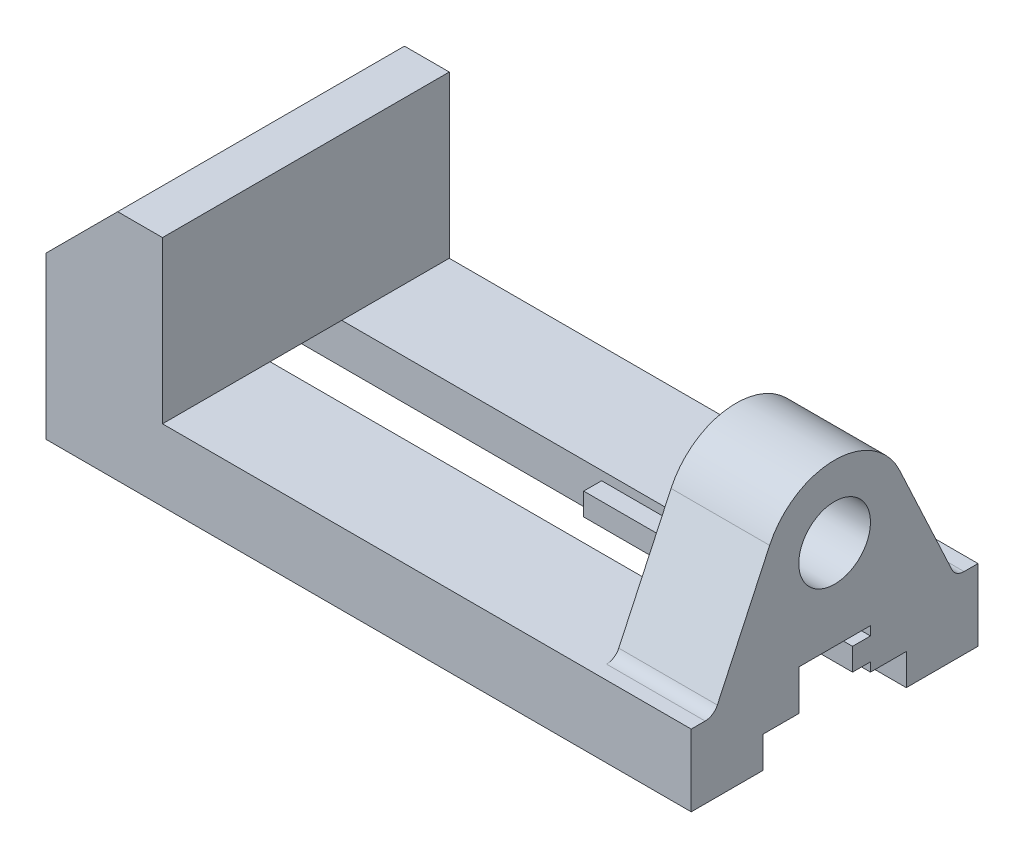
ISO-10303-21;
HEADER;
FILE_DESCRIPTION(('STEP AP214'),'2;1');
FILE_NAME('part.step','',(''),(''),'','','');
FILE_SCHEMA(('AUTOMOTIVE_DESIGN { 1 0 10303 214 1 1 1 1 }'));
ENDSEC;
DATA;
#1=APPLICATION_CONTEXT('core data for automotive mechanical design processes');
#2=APPLICATION_PROTOCOL_DEFINITION('international standard','automotive_design',2000,#1);
#3=PRODUCT_CONTEXT('',#1,'mechanical');
#4=PRODUCT('Part','Part','',(#3));
#5=PRODUCT_RELATED_PRODUCT_CATEGORY('part','',(#4));
#6=PRODUCT_DEFINITION_FORMATION('','',#4);
#7=PRODUCT_DEFINITION_CONTEXT('part definition',#1,'design');
#8=PRODUCT_DEFINITION('design','',#6,#7);
#9=PRODUCT_DEFINITION_SHAPE('','',#8);
#10=(LENGTH_UNIT() NAMED_UNIT(*) SI_UNIT(.MILLI.,.METRE.));
#11=(NAMED_UNIT(*) PLANE_ANGLE_UNIT() SI_UNIT($,.RADIAN.));
#12=(NAMED_UNIT(*) SI_UNIT($,.STERADIAN.) SOLID_ANGLE_UNIT());
#13=UNCERTAINTY_MEASURE_WITH_UNIT(LENGTH_MEASURE(1.E-05),#10,'distance_accuracy_value','');
#14=(GEOMETRIC_REPRESENTATION_CONTEXT(3) GLOBAL_UNCERTAINTY_ASSIGNED_CONTEXT((#13)) GLOBAL_UNIT_ASSIGNED_CONTEXT((#10,
#11,#12)) REPRESENTATION_CONTEXT('',''));
#15=CARTESIAN_POINT('',(0.,0.,0.));
#16=DIRECTION('',(0.,0.,1.));
#17=DIRECTION('',(1.,0.,0.));
#18=AXIS2_PLACEMENT_3D('',#15,#16,#17);
#19=CARTESIAN_POINT('',(0.,0.,32.));
#20=DIRECTION('',(0.,1.,0.));
#21=DIRECTION('',(0.,0.,1.));
#22=AXIS2_PLACEMENT_3D('',#19,#20,#21);
#23=PLANE('',#22);
#24=CARTESIAN_POINT('',(36.,0.,22.));
#25=DIRECTION('',(0.,-1.,0.));
#26=DIRECTION('',(0.,0.,-1.));
#27=AXIS2_PLACEMENT_3D('',#24,#25,#26);
#28=CIRCLE('',#27,3.);
#29=CARTESIAN_POINT('',(36.,0.,19.));
#30=VERTEX_POINT('',#29);
#31=EDGE_CURVE('E270',#30,#30,#28,.T.);
#32=ORIENTED_EDGE('',*,*,#31,.F.);
#33=EDGE_LOOP('',(#32));
#34=FACE_BOUND('',#33,.T.);
#35=CARTESIAN_POINT('',(106.,0.,22.));
#36=DIRECTION('',(0.,-1.,0.));
#37=DIRECTION('',(0.,0.,-1.));
#38=AXIS2_PLACEMENT_3D('',#35,#36,#37);
#39=CIRCLE('',#38,3.);
#40=CARTESIAN_POINT('',(106.,0.,19.));
#41=VERTEX_POINT('',#40);
#42=EDGE_CURVE('E276',#41,#41,#39,.T.);
#43=ORIENTED_EDGE('',*,*,#42,.F.);
#44=EDGE_LOOP('',(#43));
#45=FACE_BOUND('',#44,.T.);
#46=DIRECTION('',(0.,0.,-1.));
#47=VECTOR('',#46,1.);
#48=CARTESIAN_POINT('',(0.,0.,32.));
#49=LINE('',#48,#47);
#50=CARTESIAN_POINT('',(0.,0.,32.));
#51=VERTEX_POINT('',#50);
#52=CARTESIAN_POINT('',(0.,0.,16.));
#53=VERTEX_POINT('',#52);
#54=EDGE_CURVE('E434',#51,#53,#49,.T.);
#55=ORIENTED_EDGE('',*,*,#54,.T.);
#56=DIRECTION('',(1.,0.,0.));
#57=VECTOR('',#56,1.);
#58=CARTESIAN_POINT('',(0.,0.,16.));
#59=LINE('',#58,#57);
#60=CARTESIAN_POINT('',(144.,0.,16.));
#61=VERTEX_POINT('',#60);
#62=EDGE_CURVE('E324',#53,#61,#59,.T.);
#63=ORIENTED_EDGE('',*,*,#62,.T.);
#64=DIRECTION('',(0.,0.,-1.));
#65=VECTOR('',#64,1.);
#66=CARTESIAN_POINT('',(144.,0.,32.));
#67=LINE('',#66,#65);
#68=CARTESIAN_POINT('',(144.,0.,32.));
#69=VERTEX_POINT('',#68);
#70=EDGE_CURVE('E430',#69,#61,#67,.T.);
#71=ORIENTED_EDGE('',*,*,#70,.F.);
#72=DIRECTION('',(1.,0.,0.));
#73=VECTOR('',#72,1.);
#74=CARTESIAN_POINT('',(0.,0.,32.));
#75=LINE('',#74,#73);
#76=EDGE_CURVE('E388',#51,#69,#75,.T.);
#77=ORIENTED_EDGE('',*,*,#76,.F.);
#78=EDGE_LOOP('',(#55,#63,#71,#77));
#79=FACE_BOUND('',#78,.T.);
#80=ADVANCED_FACE('F34',(#34,#45,#79),#23,.F.);
#81=CARTESIAN_POINT('',(144.,16.,32.));
#82=DIRECTION('',(0.,-1.,0.));
#83=DIRECTION('',(1.,0.,0.));
#84=AXIS2_PLACEMENT_3D('',#81,#82,#83);
#85=PLANE('',#84);
#86=DIRECTION('',(0.,0.,-1.));
#87=VECTOR('',#86,1.);
#88=CARTESIAN_POINT('',(122.,16.,26.9801998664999));
#89=LINE('',#88,#87);
#90=CARTESIAN_POINT('',(122.,16.,28.8914106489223));
#91=VERTEX_POINT('',#90);
#92=CARTESIAN_POINT('',(122.,16.,7.99999999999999));
#93=VERTEX_POINT('',#92);
#94=EDGE_CURVE('E356',#91,#93,#89,.T.);
#95=ORIENTED_EDGE('',*,*,#94,.T.);
#96=DIRECTION('',(1.,0.,0.));
#97=VECTOR('',#96,1.);
#98=CARTESIAN_POINT('',(0.,16.,7.99999999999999));
#99=LINE('',#98,#97);
#100=CARTESIAN_POINT('',(26.,16.,7.99999999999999));
#101=VERTEX_POINT('',#100);
#102=EDGE_CURVE('E335',#101,#93,#99,.T.);
#103=ORIENTED_EDGE('',*,*,#102,.F.);
#104=DIRECTION('',(0.,0.,-1.));
#105=VECTOR('',#104,1.);
#106=CARTESIAN_POINT('',(26.,16.,32.));
#107=LINE('',#106,#105);
#108=CARTESIAN_POINT('',(26.,16.,32.));
#109=VERTEX_POINT('',#108);
#110=EDGE_CURVE('E422',#109,#101,#107,.T.);
#111=ORIENTED_EDGE('',*,*,#110,.F.);
#112=DIRECTION('',(-1.,0.,0.));
#113=VECTOR('',#112,1.);
#114=CARTESIAN_POINT('',(144.,16.,32.));
#115=LINE('',#114,#113);
#116=CARTESIAN_POINT('',(144.,16.,32.));
#117=VERTEX_POINT('',#116);
#118=EDGE_CURVE('E392',#117,#109,#115,.T.);
#119=ORIENTED_EDGE('',*,*,#118,.F.);
#120=DIRECTION('',(0.,0.,-1.));
#121=VECTOR('',#120,1.);
#122=CARTESIAN_POINT('',(144.,16.,32.));
#123=LINE('',#122,#121);
#124=CARTESIAN_POINT('',(144.,16.,28.8914106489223));
#125=VERTEX_POINT('',#124);
#126=EDGE_CURVE('E426',#117,#125,#123,.T.);
#127=ORIENTED_EDGE('',*,*,#126,.T.);
#128=DIRECTION('',(1.,0.,0.));
#129=VECTOR('',#128,1.);
#130=CARTESIAN_POINT('',(144.,16.,28.8914106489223));
#131=LINE('',#130,#129);
#132=EDGE_CURVE('E440',#125,#91,#131,.F.);
#133=ORIENTED_EDGE('',*,*,#132,.T.);
#134=EDGE_LOOP('',(#95,#103,#111,#119,#127,#133));
#135=FACE_BOUND('',#134,.T.);
#136=ADVANCED_FACE('F466',(#135),#85,.F.);
#137=CARTESIAN_POINT('',(16.,52.,32.));
#138=DIRECTION('',(0.707106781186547,-0.707106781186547,0.));
#139=DIRECTION('',(0.707106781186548,0.707106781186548,0.));
#140=AXIS2_PLACEMENT_3D('',#137,#138,#139);
#141=PLANE('',#140);
#142=DIRECTION('',(-0.707106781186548,-0.707106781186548,0.));
#143=VECTOR('',#142,1.);
#144=CARTESIAN_POINT('',(16.,52.,-32.));
#145=LINE('',#144,#143);
#146=CARTESIAN_POINT('',(16.,52.,-32.));
#147=VERTEX_POINT('',#146);
#148=CARTESIAN_POINT('',(0.,36.,-32.));
#149=VERTEX_POINT('',#148);
#150=EDGE_CURVE('E379',#147,#149,#145,.T.);
#151=ORIENTED_EDGE('',*,*,#150,.T.);
#152=DIRECTION('',(0.,0.,-1.));
#153=VECTOR('',#152,1.);
#154=CARTESIAN_POINT('',(0.,36.,32.));
#155=LINE('',#154,#153);
#156=CARTESIAN_POINT('',(0.,36.,32.));
#157=VERTEX_POINT('',#156);
#158=EDGE_CURVE('E437',#157,#149,#155,.T.);
#159=ORIENTED_EDGE('',*,*,#158,.F.);
#160=DIRECTION('',(-0.707106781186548,-0.707106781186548,0.));
#161=VECTOR('',#160,1.);
#162=CARTESIAN_POINT('',(16.,52.,32.));
#163=LINE('',#162,#161);
#164=CARTESIAN_POINT('',(16.,52.,32.));
#165=VERTEX_POINT('',#164);
#166=EDGE_CURVE('E382',#165,#157,#163,.T.);
#167=ORIENTED_EDGE('',*,*,#166,.F.);
#168=DIRECTION('',(0.,0.,-1.));
#169=VECTOR('',#168,1.);
#170=CARTESIAN_POINT('',(16.,52.,32.));
#171=LINE('',#170,#169);
#172=EDGE_CURVE('E398',#165,#147,#171,.T.);
#173=ORIENTED_EDGE('',*,*,#172,.T.);
#174=EDGE_LOOP('',(#151,#159,#167,#173));
#175=FACE_BOUND('',#174,.T.);
#176=ADVANCED_FACE('F555',(#175),#141,.F.);
#177=CARTESIAN_POINT('',(0.,36.,32.));
#178=DIRECTION('',(1.,0.,0.));
#179=DIRECTION('',(0.,1.,0.));
#180=AXIS2_PLACEMENT_3D('',#177,#178,#179);
#181=PLANE('',#180);
#182=DIRECTION('',(0.,0.,1.));
#183=VECTOR('',#182,1.);
#184=CARTESIAN_POINT('',(0.,7.,16.));
#185=LINE('',#184,#183);
#186=CARTESIAN_POINT('',(0.,7.,8.00000000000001));
#187=VERTEX_POINT('',#186);
#188=CARTESIAN_POINT('',(0.,7.,16.));
#189=VERTEX_POINT('',#188);
#190=EDGE_CURVE('E299',#187,#189,#185,.T.);
#191=ORIENTED_EDGE('',*,*,#190,.T.);
#192=DIRECTION('',(0.,-1.,0.));
#193=VECTOR('',#192,1.);
#194=CARTESIAN_POINT('',(0.,0.,16.));
#195=LINE('',#194,#193);
#196=EDGE_CURVE('E302',#189,#53,#195,.T.);
#197=ORIENTED_EDGE('',*,*,#196,.T.);
#198=ORIENTED_EDGE('',*,*,#54,.F.);
#199=DIRECTION('',(0.,-1.,0.));
#200=VECTOR('',#199,1.);
#201=CARTESIAN_POINT('',(0.,36.,32.));
#202=LINE('',#201,#200);
#203=EDGE_CURVE('E385',#157,#51,#202,.T.);
#204=ORIENTED_EDGE('',*,*,#203,.F.);
#205=ORIENTED_EDGE('',*,*,#158,.T.);
#206=DIRECTION('',(0.,-1.,0.));
#207=VECTOR('',#206,1.);
#208=CARTESIAN_POINT('',(0.,36.,-32.));
#209=LINE('',#208,#207);
#210=CARTESIAN_POINT('',(0.,0.,-32.));
#211=VERTEX_POINT('',#210);
#212=EDGE_CURVE('E401',#149,#211,#209,.T.);
#213=ORIENTED_EDGE('',*,*,#212,.T.);
#214=CARTESIAN_POINT('',(0.,0.,-16.));
#215=VERTEX_POINT('',#214);
#216=EDGE_CURVE('E433',#215,#211,#49,.T.);
#217=ORIENTED_EDGE('',*,*,#216,.F.);
#218=DIRECTION('',(0.,1.,0.));
#219=VECTOR('',#218,1.);
#220=CARTESIAN_POINT('',(0.,7.,-16.));
#221=LINE('',#220,#219);
#222=CARTESIAN_POINT('',(0.,7.,-16.));
#223=VERTEX_POINT('',#222);
#224=EDGE_CURVE('E283',#215,#223,#221,.T.);
#225=ORIENTED_EDGE('',*,*,#224,.T.);
#226=DIRECTION('',(0.,0.,1.));
#227=VECTOR('',#226,1.);
#228=CARTESIAN_POINT('',(0.,7.,-8.));
#229=LINE('',#228,#227);
#230=CARTESIAN_POINT('',(0.,7.,-8.));
#231=VERTEX_POINT('',#230);
#232=EDGE_CURVE('E286',#223,#231,#229,.T.);
#233=ORIENTED_EDGE('',*,*,#232,.T.);
#234=DIRECTION('',(0.,1.,0.));
#235=VECTOR('',#234,1.);
#236=CARTESIAN_POINT('',(0.,16.,-8.));
#237=LINE('',#236,#235);
#238=CARTESIAN_POINT('',(0.,16.,-8.));
#239=VERTEX_POINT('',#238);
#240=EDGE_CURVE('E290',#231,#239,#237,.T.);
#241=ORIENTED_EDGE('',*,*,#240,.T.);
#242=DIRECTION('',(0.,0.,1.));
#243=VECTOR('',#242,1.);
#244=CARTESIAN_POINT('',(0.,16.,7.99999999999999));
#245=LINE('',#244,#243);
#246=CARTESIAN_POINT('',(0.,16.,7.99999999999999));
#247=VERTEX_POINT('',#246);
#248=EDGE_CURVE('E293',#239,#247,#245,.T.);
#249=ORIENTED_EDGE('',*,*,#248,.T.);
#250=DIRECTION('',(0.,-1.,0.));
#251=VECTOR('',#250,1.);
#252=CARTESIAN_POINT('',(0.,7.,8.00000000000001));
#253=LINE('',#252,#251);
#254=EDGE_CURVE('E296',#247,#187,#253,.T.);
#255=ORIENTED_EDGE('',*,*,#254,.T.);
#256=EDGE_LOOP('',(#191,#197,#198,#204,#205,#213,#217,#225,#233,#241,#249,#255));
#257=FACE_BOUND('',#256,.T.);
#258=ADVANCED_FACE('F528',(#257),#181,.F.);
#259=CARTESIAN_POINT('',(106.,0.,-22.));
#260=DIRECTION('',(0.,-1.,0.));
#261=DIRECTION('',(0.,0.,-1.));
#262=AXIS2_PLACEMENT_3D('',#259,#260,#261);
#263=CIRCLE('',#262,3.);
#264=CARTESIAN_POINT('',(106.,0.,-25.));
#265=VERTEX_POINT('',#264);
#266=EDGE_CURVE('E256',#265,#265,#263,.T.);
#267=ORIENTED_EDGE('',*,*,#266,.F.);
#268=EDGE_LOOP('',(#267));
#269=FACE_BOUND('',#268,.T.);
#270=CARTESIAN_POINT('',(36.,0.,-22.));
#271=DIRECTION('',(0.,-1.,0.));
#272=DIRECTION('',(0.,0.,-1.));
#273=AXIS2_PLACEMENT_3D('',#270,#271,#272);
#274=CIRCLE('',#273,3.);
#275=CARTESIAN_POINT('',(36.,0.,-25.));
#276=VERTEX_POINT('',#275);
#277=EDGE_CURVE('E264',#276,#276,#274,.T.);
#278=ORIENTED_EDGE('',*,*,#277,.F.);
#279=EDGE_LOOP('',(#278));
#280=FACE_BOUND('',#279,.T.);
#281=CARTESIAN_POINT('',(144.,0.,-16.));
#282=VERTEX_POINT('',#281);
#283=CARTESIAN_POINT('',(144.,0.,-32.));
#284=VERTEX_POINT('',#283);
#285=EDGE_CURVE('E429',#282,#284,#67,.T.);
#286=ORIENTED_EDGE('',*,*,#285,.F.);
#287=DIRECTION('',(1.,0.,0.));
#288=VECTOR('',#287,1.);
#289=CARTESIAN_POINT('',(0.,0.,-16.));
#290=LINE('',#289,#288);
#291=EDGE_CURVE('E305',#215,#282,#290,.T.);
#292=ORIENTED_EDGE('',*,*,#291,.F.);
#293=ORIENTED_EDGE('',*,*,#216,.T.);
#294=DIRECTION('',(1.,0.,0.));
#295=VECTOR('',#294,1.);
#296=CARTESIAN_POINT('',(0.,0.,-32.));
#297=LINE('',#296,#295);
#298=EDGE_CURVE('E404',#211,#284,#297,.T.);
#299=ORIENTED_EDGE('',*,*,#298,.T.);
#300=EDGE_LOOP('',(#286,#292,#293,#299));
#301=FACE_BOUND('',#300,.T.);
#302=ADVANCED_FACE('F551',(#269,#280,#301),#23,.F.);
#303=CARTESIAN_POINT('',(144.,0.,32.));
#304=DIRECTION('',(-1.,0.,0.));
#305=DIRECTION('',(0.,0.,1.));
#306=AXIS2_PLACEMENT_3D('',#303,#304,#305);
#307=PLANE('',#306);
#308=ORIENTED_EDGE('',*,*,#70,.T.);
#309=DIRECTION('',(0.,-1.,0.));
#310=VECTOR('',#309,1.);
#311=CARTESIAN_POINT('',(144.,0.,16.));
#312=LINE('',#311,#310);
#313=CARTESIAN_POINT('',(144.,7.,16.));
#314=VERTEX_POINT('',#313);
#315=EDGE_CURVE('E287',#314,#61,#312,.T.);
#316=ORIENTED_EDGE('',*,*,#315,.F.);
#317=DIRECTION('',(0.,0.,1.));
#318=VECTOR('',#317,1.);
#319=CARTESIAN_POINT('',(144.,7.,16.));
#320=LINE('',#319,#318);
#321=CARTESIAN_POINT('',(144.,7.,8.00000000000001));
#322=VERTEX_POINT('',#321);
#323=EDGE_CURVE('E320',#322,#314,#320,.T.);
#324=ORIENTED_EDGE('',*,*,#323,.F.);
#325=DIRECTION('',(0.,-1.,0.));
#326=VECTOR('',#325,1.);
#327=CARTESIAN_POINT('',(144.,7.,8.00000000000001));
#328=LINE('',#327,#326);
#329=CARTESIAN_POINT('',(144.,16.,7.99999999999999));
#330=VERTEX_POINT('',#329);
#331=EDGE_CURVE('E317',#330,#322,#328,.T.);
#332=ORIENTED_EDGE('',*,*,#331,.F.);
#333=DIRECTION('',(0.,0.,1.));
#334=VECTOR('',#333,1.);
#335=CARTESIAN_POINT('',(144.,16.,7.99999999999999));
#336=LINE('',#335,#334);
#337=CARTESIAN_POINT('',(144.,16.,-8.));
#338=VERTEX_POINT('',#337);
#339=EDGE_CURVE('E314',#338,#330,#336,.T.);
#340=ORIENTED_EDGE('',*,*,#339,.F.);
#341=DIRECTION('',(0.,1.,0.));
#342=VECTOR('',#341,1.);
#343=CARTESIAN_POINT('',(144.,16.,-8.));
#344=LINE('',#343,#342);
#345=CARTESIAN_POINT('',(144.,13.9999999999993,-8.));
#346=VERTEX_POINT('',#345);
#347=EDGE_CURVE('E311',#346,#338,#344,.T.);
#348=ORIENTED_EDGE('',*,*,#347,.F.);
#349=DIRECTION('',(0.,0.,1.));
#350=VECTOR('',#349,1.);
#351=CARTESIAN_POINT('',(144.,13.9999999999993,-8.));
#352=LINE('',#351,#350);
#353=CARTESIAN_POINT('',(144.,13.9999999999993,-4.));
#354=VERTEX_POINT('',#353);
#355=EDGE_CURVE('E250',#346,#354,#352,.T.);
#356=ORIENTED_EDGE('',*,*,#355,.T.);
#357=DIRECTION('',(0.,-1.,0.));
#358=VECTOR('',#357,1.);
#359=CARTESIAN_POINT('',(144.,13.9999999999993,-4.));
#360=LINE('',#359,#358);
#361=CARTESIAN_POINT('',(144.,8.99999999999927,-4.));
#362=VERTEX_POINT('',#361);
#363=EDGE_CURVE('E229',#354,#362,#360,.T.);
#364=ORIENTED_EDGE('',*,*,#363,.T.);
#365=DIRECTION('',(0.,0.,-1.));
#366=VECTOR('',#365,1.);
#367=CARTESIAN_POINT('',(144.,8.99999999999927,-8.));
#368=LINE('',#367,#366);
#369=CARTESIAN_POINT('',(144.,8.99999999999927,-8.));
#370=VERTEX_POINT('',#369);
#371=EDGE_CURVE('E246',#362,#370,#368,.T.);
#372=ORIENTED_EDGE('',*,*,#371,.T.);
#373=CARTESIAN_POINT('',(144.,7.,-8.));
#374=VERTEX_POINT('',#373);
#375=EDGE_CURVE('E312',#374,#370,#344,.T.);
#376=ORIENTED_EDGE('',*,*,#375,.F.);
#377=DIRECTION('',(0.,0.,1.));
#378=VECTOR('',#377,1.);
#379=CARTESIAN_POINT('',(144.,7.,-8.));
#380=LINE('',#379,#378);
#381=CARTESIAN_POINT('',(144.,7.,-16.));
#382=VERTEX_POINT('',#381);
#383=EDGE_CURVE('E308',#382,#374,#380,.T.);
#384=ORIENTED_EDGE('',*,*,#383,.F.);
#385=DIRECTION('',(0.,1.,0.));
#386=VECTOR('',#385,1.);
#387=CARTESIAN_POINT('',(144.,7.,-16.));
#388=LINE('',#387,#386);
#389=EDGE_CURVE('E282',#282,#382,#388,.T.);
#390=ORIENTED_EDGE('',*,*,#389,.F.);
#391=ORIENTED_EDGE('',*,*,#285,.T.);
#392=DIRECTION('',(0.,1.,0.));
#393=VECTOR('',#392,1.);
#394=CARTESIAN_POINT('',(144.,0.,-32.));
#395=LINE('',#394,#393);
#396=CARTESIAN_POINT('',(144.,16.,-32.));
#397=VERTEX_POINT('',#396);
#398=EDGE_CURVE('E407',#284,#397,#395,.T.);
#399=ORIENTED_EDGE('',*,*,#398,.T.);
#400=CARTESIAN_POINT('',(144.,16.,-28.8914106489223));
#401=VERTEX_POINT('',#400);
#402=EDGE_CURVE('E425',#401,#397,#123,.T.);
#403=ORIENTED_EDGE('',*,*,#402,.F.);
#404=CARTESIAN_POINT('',(144.,19.,-28.8914106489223));
#405=DIRECTION('',(-1.,0.,0.));
#406=DIRECTION('',(0.,0.,1.));
#407=AXIS2_PLACEMENT_3D('',#404,#405,#406);
#408=CIRCLE('',#407,3.);
#409=CARTESIAN_POINT('',(144.,17.7321452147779,-26.1724872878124));
#410=VERTEX_POINT('',#409);
#411=EDGE_CURVE('E451',#401,#410,#408,.T.);
#412=ORIENTED_EDGE('',*,*,#411,.T.);
#413=DIRECTION('',(0.,0.906307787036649,0.4226182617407));
#414=VECTOR('',#413,1.);
#415=CARTESIAN_POINT('',(144.,16.,-26.9801998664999));
#416=LINE('',#415,#414);
#417=CARTESIAN_POINT('',(144.,42.7618921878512,-14.5009245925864));
#418=VERTEX_POINT('',#417);
#419=EDGE_CURVE('E353',#410,#418,#416,.T.);
#420=ORIENTED_EDGE('',*,*,#419,.T.);
#421=CARTESIAN_POINT('',(144.,36.,0.));
#422=DIRECTION('',(1.,0.,0.));
#423=DIRECTION('',(0.,0.,-1.));
#424=AXIS2_PLACEMENT_3D('',#421,#422,#423);
#425=CIRCLE('',#424,16.);
#426=CARTESIAN_POINT('',(144.,42.7618921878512,14.5009245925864));
#427=VERTEX_POINT('',#426);
#428=EDGE_CURVE('E371',#418,#427,#425,.T.);
#429=ORIENTED_EDGE('',*,*,#428,.T.);
#430=DIRECTION('',(0.,-0.906307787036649,0.4226182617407));
#431=VECTOR('',#430,1.);
#432=CARTESIAN_POINT('',(144.,16.,26.9801998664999));
#433=LINE('',#432,#431);
#434=CARTESIAN_POINT('',(144.,17.7321452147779,26.1724872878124));
#435=VERTEX_POINT('',#434);
#436=EDGE_CURVE('E374',#427,#435,#433,.T.);
#437=ORIENTED_EDGE('',*,*,#436,.T.);
#438=CARTESIAN_POINT('',(144.,19.,28.8914106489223));
#439=DIRECTION('',(-1.,0.,0.));
#440=DIRECTION('',(0.,0.,1.));
#441=AXIS2_PLACEMENT_3D('',#438,#439,#440);
#442=CIRCLE('',#441,3.);
#443=EDGE_CURVE('E42',#435,#125,#442,.T.);
#444=ORIENTED_EDGE('',*,*,#443,.T.);
#445=ORIENTED_EDGE('',*,*,#126,.F.);
#446=DIRECTION('',(0.,1.,0.));
#447=VECTOR('',#446,1.);
#448=CARTESIAN_POINT('',(144.,0.,32.));
#449=LINE('',#448,#447);
#450=EDGE_CURVE('E390',#69,#117,#449,.T.);
#451=ORIENTED_EDGE('',*,*,#450,.F.);
#452=EDGE_LOOP('',(#308,#316,#324,#332,#340,#348,#356,#364,#372,#376,#384,#390,#391,#399,#403,
#412,#420,#429,#437,#444,#445,#451));
#453=FACE_BOUND('',#452,.T.);
#454=CARTESIAN_POINT('',(144.,36.,0.));
#455=DIRECTION('',(1.,0.,0.));
#456=DIRECTION('',(0.,0.,-1.));
#457=AXIS2_PLACEMENT_3D('',#454,#455,#456);
#458=CIRCLE('',#457,8.);
#459=CARTESIAN_POINT('',(144.,36.,-8.));
#460=VERTEX_POINT('',#459);
#461=EDGE_CURVE('E349',#460,#460,#458,.T.);
#462=ORIENTED_EDGE('',*,*,#461,.F.);
#463=EDGE_LOOP('',(#462));
#464=FACE_BOUND('',#463,.T.);
#465=ADVANCED_FACE('F457',(#453,#464),#307,.F.);
#466=CARTESIAN_POINT('',(26.,16.,-8.));
#467=VERTEX_POINT('',#466);
#468=CARTESIAN_POINT('',(26.,16.,-32.));
#469=VERTEX_POINT('',#468);
#470=EDGE_CURVE('E421',#467,#469,#107,.T.);
#471=ORIENTED_EDGE('',*,*,#470,.F.);
#472=DIRECTION('',(1.,0.,0.));
#473=VECTOR('',#472,1.);
#474=CARTESIAN_POINT('',(0.,16.,-8.));
#475=LINE('',#474,#473);
#476=CARTESIAN_POINT('',(122.,16.,-8.));
#477=VERTEX_POINT('',#476);
#478=EDGE_CURVE('E340',#467,#477,#475,.T.);
#479=ORIENTED_EDGE('',*,*,#478,.T.);
#480=CARTESIAN_POINT('',(122.,16.,-28.8914106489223));
#481=VERTEX_POINT('',#480);
#482=EDGE_CURVE('E361',#477,#481,#89,.T.);
#483=ORIENTED_EDGE('',*,*,#482,.T.);
#484=DIRECTION('',(1.,0.,0.));
#485=VECTOR('',#484,1.);
#486=CARTESIAN_POINT('',(144.,16.,-28.8914106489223));
#487=LINE('',#486,#485);
#488=EDGE_CURVE('E443',#481,#401,#487,.T.);
#489=ORIENTED_EDGE('',*,*,#488,.T.);
#490=ORIENTED_EDGE('',*,*,#402,.T.);
#491=DIRECTION('',(-1.,0.,0.));
#492=VECTOR('',#491,1.);
#493=CARTESIAN_POINT('',(144.,16.,-32.));
#494=LINE('',#493,#492);
#495=EDGE_CURVE('E410',#397,#469,#494,.T.);
#496=ORIENTED_EDGE('',*,*,#495,.T.);
#497=EDGE_LOOP('',(#471,#479,#483,#489,#490,#496));
#498=FACE_BOUND('',#497,.T.);
#499=ADVANCED_FACE('F491',(#498),#85,.F.);
#500=CARTESIAN_POINT('',(26.,16.,32.));
#501=DIRECTION('',(-1.,0.,0.));
#502=DIRECTION('',(0.,-1.,0.));
#503=AXIS2_PLACEMENT_3D('',#500,#501,#502);
#504=PLANE('',#503);
#505=DIRECTION('',(0.,1.,0.));
#506=VECTOR('',#505,1.);
#507=CARTESIAN_POINT('',(26.,16.,-32.));
#508=LINE('',#507,#506);
#509=CARTESIAN_POINT('',(26.,52.,-32.));
#510=VERTEX_POINT('',#509);
#511=EDGE_CURVE('E413',#469,#510,#508,.T.);
#512=ORIENTED_EDGE('',*,*,#511,.T.);
#513=DIRECTION('',(0.,0.,-1.));
#514=VECTOR('',#513,1.);
#515=CARTESIAN_POINT('',(26.,52.,32.));
#516=LINE('',#515,#514);
#517=CARTESIAN_POINT('',(26.,52.,32.));
#518=VERTEX_POINT('',#517);
#519=EDGE_CURVE('E418',#518,#510,#516,.T.);
#520=ORIENTED_EDGE('',*,*,#519,.F.);
#521=DIRECTION('',(0.,1.,0.));
#522=VECTOR('',#521,1.);
#523=CARTESIAN_POINT('',(26.,16.,32.));
#524=LINE('',#523,#522);
#525=EDGE_CURVE('E394',#109,#518,#524,.T.);
#526=ORIENTED_EDGE('',*,*,#525,.F.);
#527=ORIENTED_EDGE('',*,*,#110,.T.);
#528=DIRECTION('',(0.,0.,-1.));
#529=VECTOR('',#528,1.);
#530=CARTESIAN_POINT('',(26.,16.,32.));
#531=LINE('',#530,#529);
#532=EDGE_CURVE('E327',#101,#467,#531,.T.);
#533=ORIENTED_EDGE('',*,*,#532,.T.);
#534=ORIENTED_EDGE('',*,*,#470,.T.);
#535=EDGE_LOOP('',(#512,#520,#526,#527,#533,#534));
#536=FACE_BOUND('',#535,.T.);
#537=ADVANCED_FACE('F505',(#536),#504,.F.);
#538=CARTESIAN_POINT('',(26.,52.,32.));
#539=DIRECTION('',(0.,-1.,0.));
#540=DIRECTION('',(0.,0.,-1.));
#541=AXIS2_PLACEMENT_3D('',#538,#539,#540);
#542=PLANE('',#541);
#543=DIRECTION('',(-1.,0.,0.));
#544=VECTOR('',#543,1.);
#545=CARTESIAN_POINT('',(26.,52.,-32.));
#546=LINE('',#545,#544);
#547=EDGE_CURVE('E386',#510,#147,#546,.T.);
#548=ORIENTED_EDGE('',*,*,#547,.T.);
#549=ORIENTED_EDGE('',*,*,#172,.F.);
#550=DIRECTION('',(-1.,0.,0.));
#551=VECTOR('',#550,1.);
#552=CARTESIAN_POINT('',(26.,52.,32.));
#553=LINE('',#552,#551);
#554=EDGE_CURVE('E396',#518,#165,#553,.T.);
#555=ORIENTED_EDGE('',*,*,#554,.F.);
#556=ORIENTED_EDGE('',*,*,#519,.T.);
#557=EDGE_LOOP('',(#548,#549,#555,#556));
#558=FACE_BOUND('',#557,.T.);
#559=ADVANCED_FACE('F580',(#558),#542,.F.);
#560=CARTESIAN_POINT('',(0.,36.,32.));
#561=DIRECTION('',(0.,0.,1.));
#562=DIRECTION('',(1.,0.,0.));
#563=AXIS2_PLACEMENT_3D('',#560,#561,#562);
#564=PLANE('',#563);
#565=ORIENTED_EDGE('',*,*,#166,.T.);
#566=ORIENTED_EDGE('',*,*,#203,.T.);
#567=ORIENTED_EDGE('',*,*,#76,.T.);
#568=ORIENTED_EDGE('',*,*,#450,.T.);
#569=ORIENTED_EDGE('',*,*,#118,.T.);
#570=ORIENTED_EDGE('',*,*,#525,.T.);
#571=ORIENTED_EDGE('',*,*,#554,.T.);
#572=EDGE_LOOP('',(#565,#566,#567,#568,#569,#570,#571));
#573=FACE_BOUND('',#572,.T.);
#574=ADVANCED_FACE('F583',(#573),#564,.T.);
#575=CARTESIAN_POINT('',(0.,36.,-32.));
#576=DIRECTION('',(0.,0.,1.));
#577=DIRECTION('',(1.,0.,0.));
#578=AXIS2_PLACEMENT_3D('',#575,#576,#577);
#579=PLANE('',#578);
#580=ORIENTED_EDGE('',*,*,#150,.F.);
#581=ORIENTED_EDGE('',*,*,#547,.F.);
#582=ORIENTED_EDGE('',*,*,#511,.F.);
#583=ORIENTED_EDGE('',*,*,#495,.F.);
#584=ORIENTED_EDGE('',*,*,#398,.F.);
#585=ORIENTED_EDGE('',*,*,#298,.F.);
#586=ORIENTED_EDGE('',*,*,#212,.F.);
#587=EDGE_LOOP('',(#580,#581,#582,#583,#584,#585,#586));
#588=FACE_BOUND('',#587,.T.);
#589=ADVANCED_FACE('F502',(#588),#579,.F.);
#590=CARTESIAN_POINT('',(122.,16.,26.9801998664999));
#591=DIRECTION('',(0.,0.4226182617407,0.90630778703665));
#592=DIRECTION('',(0.,-0.90630778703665,0.4226182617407));
#593=AXIS2_PLACEMENT_3D('',#590,#591,#592);
#594=PLANE('',#593);
#595=DIRECTION('',(0.,-0.906307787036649,0.4226182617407));
#596=VECTOR('',#595,1.);
#597=CARTESIAN_POINT('',(122.,16.,26.9801998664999));
#598=LINE('',#597,#596);
#599=CARTESIAN_POINT('',(122.,42.7618921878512,14.5009245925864));
#600=VERTEX_POINT('',#599);
#601=CARTESIAN_POINT('',(122.,17.7321452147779,26.1724872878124));
#602=VERTEX_POINT('',#601);
#603=EDGE_CURVE('E366',#600,#602,#598,.T.);
#604=ORIENTED_EDGE('',*,*,#603,.T.);
#605=DIRECTION('',(1.,0.,0.));
#606=VECTOR('',#605,1.);
#607=CARTESIAN_POINT('',(122.,17.7321452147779,26.1724872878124));
#608=LINE('',#607,#606);
#609=EDGE_CURVE('E448',#602,#435,#608,.T.);
#610=ORIENTED_EDGE('',*,*,#609,.T.);
#611=ORIENTED_EDGE('',*,*,#436,.F.);
#612=DIRECTION('',(1.,0.,0.));
#613=VECTOR('',#612,1.);
#614=CARTESIAN_POINT('',(122.,42.7618921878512,14.5009245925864));
#615=LINE('',#614,#613);
#616=EDGE_CURVE('E377',#600,#427,#615,.T.);
#617=ORIENTED_EDGE('',*,*,#616,.F.);
#618=EDGE_LOOP('',(#604,#610,#611,#617));
#619=FACE_BOUND('',#618,.T.);
#620=ADVANCED_FACE('F475',(#619),#594,.T.);
#621=CARTESIAN_POINT('',(122.,36.,0.));
#622=DIRECTION('',(1.,0.,0.));
#623=DIRECTION('',(0.,0.,-1.));
#624=AXIS2_PLACEMENT_3D('',#621,#622,#623);
#625=CYLINDRICAL_SURFACE('',#624,16.);
#626=ORIENTED_EDGE('',*,*,#428,.F.);
#627=DIRECTION('',(1.,0.,0.));
#628=VECTOR('',#627,1.);
#629=CARTESIAN_POINT('',(122.,42.7618921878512,-14.5009245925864));
#630=LINE('',#629,#628);
#631=CARTESIAN_POINT('',(122.,42.7618921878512,-14.5009245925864));
#632=VERTEX_POINT('',#631);
#633=EDGE_CURVE('E369',#632,#418,#630,.T.);
#634=ORIENTED_EDGE('',*,*,#633,.F.);
#635=CARTESIAN_POINT('',(122.,36.,0.));
#636=DIRECTION('',(1.,0.,0.));
#637=DIRECTION('',(0.,0.,-1.));
#638=AXIS2_PLACEMENT_3D('',#635,#636,#637);
#639=CIRCLE('',#638,16.);
#640=EDGE_CURVE('E363',#632,#600,#639,.T.);
#641=ORIENTED_EDGE('',*,*,#640,.T.);
#642=ORIENTED_EDGE('',*,*,#616,.T.);
#643=EDGE_LOOP('',(#626,#634,#641,#642));
#644=FACE_BOUND('',#643,.T.);
#645=ADVANCED_FACE('F479',(#644),#625,.T.);
#646=CARTESIAN_POINT('',(122.,16.,-26.9801998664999));
#647=DIRECTION('',(0.,0.4226182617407,-0.90630778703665));
#648=DIRECTION('',(0.,0.90630778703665,0.4226182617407));
#649=AXIS2_PLACEMENT_3D('',#646,#647,#648);
#650=PLANE('',#649);
#651=ORIENTED_EDGE('',*,*,#419,.F.);
#652=DIRECTION('',(1.,0.,0.));
#653=VECTOR('',#652,1.);
#654=CARTESIAN_POINT('',(122.,17.7321452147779,-26.1724872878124));
#655=LINE('',#654,#653);
#656=CARTESIAN_POINT('',(122.,17.7321452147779,-26.1724872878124));
#657=VERTEX_POINT('',#656);
#658=EDGE_CURVE('E446',#410,#657,#655,.F.);
#659=ORIENTED_EDGE('',*,*,#658,.T.);
#660=DIRECTION('',(0.,0.906307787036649,0.4226182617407));
#661=VECTOR('',#660,1.);
#662=CARTESIAN_POINT('',(122.,16.,-26.9801998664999));
#663=LINE('',#662,#661);
#664=EDGE_CURVE('E359',#657,#632,#663,.T.);
#665=ORIENTED_EDGE('',*,*,#664,.T.);
#666=ORIENTED_EDGE('',*,*,#633,.T.);
#667=EDGE_LOOP('',(#651,#659,#665,#666));
#668=FACE_BOUND('',#667,.T.);
#669=ADVANCED_FACE('F620',(#668),#650,.T.);
#670=CARTESIAN_POINT('',(122.,36.,0.));
#671=DIRECTION('',(1.,0.,0.));
#672=DIRECTION('',(0.,0.,-1.));
#673=AXIS2_PLACEMENT_3D('',#670,#671,#672);
#674=PLANE('',#673);
#675=CARTESIAN_POINT('',(122.,36.,0.));
#676=DIRECTION('',(1.,0.,0.));
#677=DIRECTION('',(0.,0.,-1.));
#678=AXIS2_PLACEMENT_3D('',#675,#676,#677);
#679=CIRCLE('',#678,8.);
#680=CARTESIAN_POINT('',(122.,36.,-8.));
#681=VERTEX_POINT('',#680);
#682=EDGE_CURVE('E350',#681,#681,#679,.T.);
#683=ORIENTED_EDGE('',*,*,#682,.T.);
#684=EDGE_LOOP('',(#683));
#685=FACE_BOUND('',#684,.T.);
#686=ORIENTED_EDGE('',*,*,#94,.F.);
#687=CARTESIAN_POINT('',(122.,19.,28.8914106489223));
#688=DIRECTION('',(1.,0.,0.));
#689=DIRECTION('',(0.,0.,-1.));
#690=AXIS2_PLACEMENT_3D('',#687,#688,#689);
#691=CIRCLE('',#690,3.);
#692=EDGE_CURVE('E11',#91,#602,#691,.T.);
#693=ORIENTED_EDGE('',*,*,#692,.T.);
#694=ORIENTED_EDGE('',*,*,#603,.F.);
#695=ORIENTED_EDGE('',*,*,#640,.F.);
#696=ORIENTED_EDGE('',*,*,#664,.F.);
#697=CARTESIAN_POINT('',(122.,19.,-28.8914106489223));
#698=DIRECTION('',(1.,0.,0.));
#699=DIRECTION('',(0.,0.,-1.));
#700=AXIS2_PLACEMENT_3D('',#697,#698,#699);
#701=CIRCLE('',#700,3.);
#702=EDGE_CURVE('E453',#657,#481,#701,.T.);
#703=ORIENTED_EDGE('',*,*,#702,.T.);
#704=ORIENTED_EDGE('',*,*,#482,.F.);
#705=EDGE_CURVE('E360',#93,#477,#89,.T.);
#706=ORIENTED_EDGE('',*,*,#705,.F.);
#707=EDGE_LOOP('',(#686,#693,#694,#695,#696,#703,#704,#706));
#708=FACE_BOUND('',#707,.T.);
#709=ADVANCED_FACE('F471',(#685,#708),#674,.F.);
#710=CARTESIAN_POINT('',(122.,36.,0.));
#711=DIRECTION('',(1.,0.,0.));
#712=DIRECTION('',(0.,0.,-1.));
#713=AXIS2_PLACEMENT_3D('',#710,#711,#712);
#714=CYLINDRICAL_SURFACE('',#713,8.);
#715=ORIENTED_EDGE('',*,*,#682,.F.);
#716=EDGE_LOOP('',(#715));
#717=FACE_BOUND('',#716,.T.);
#718=ORIENTED_EDGE('',*,*,#461,.T.);
#719=EDGE_LOOP('',(#718));
#720=FACE_BOUND('',#719,.T.);
#721=ADVANCED_FACE('F614',(#717,#720),#714,.F.);
#722=CARTESIAN_POINT('',(144.,19.,-28.8914106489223));
#723=DIRECTION('',(1.,0.,0.));
#724=DIRECTION('',(0.,1.,0.));
#725=AXIS2_PLACEMENT_3D('',#722,#723,#724);
#726=CYLINDRICAL_SURFACE('',#725,3.);
#727=ORIENTED_EDGE('',*,*,#702,.F.);
#728=ORIENTED_EDGE('',*,*,#658,.F.);
#729=ORIENTED_EDGE('',*,*,#411,.F.);
#730=ORIENTED_EDGE('',*,*,#488,.F.);
#731=EDGE_LOOP('',(#727,#728,#729,#730));
#732=FACE_BOUND('',#731,.T.);
#733=ADVANCED_FACE('F487',(#732),#726,.F.);
#734=CARTESIAN_POINT('',(122.,19.,28.8914106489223));
#735=DIRECTION('',(1.,0.,0.));
#736=DIRECTION('',(0.,1.,0.));
#737=AXIS2_PLACEMENT_3D('',#734,#735,#736);
#738=CYLINDRICAL_SURFACE('',#737,3.);
#739=ORIENTED_EDGE('',*,*,#692,.F.);
#740=ORIENTED_EDGE('',*,*,#132,.F.);
#741=ORIENTED_EDGE('',*,*,#443,.F.);
#742=ORIENTED_EDGE('',*,*,#609,.F.);
#743=EDGE_LOOP('',(#739,#740,#741,#742));
#744=FACE_BOUND('',#743,.T.);
#745=ADVANCED_FACE('F36',(#744),#738,.F.);
#746=CARTESIAN_POINT('',(0.,16.,7.99999999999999));
#747=DIRECTION('',(0.,1.,0.));
#748=DIRECTION('',(0.,0.,1.));
#749=AXIS2_PLACEMENT_3D('',#746,#747,#748);
#750=PLANE('',#749);
#751=EDGE_CURVE('E332',#247,#101,#99,.T.);
#752=ORIENTED_EDGE('',*,*,#751,.F.);
#753=ORIENTED_EDGE('',*,*,#248,.F.);
#754=EDGE_CURVE('E337',#239,#467,#475,.T.);
#755=ORIENTED_EDGE('',*,*,#754,.T.);
#756=ORIENTED_EDGE('',*,*,#532,.F.);
#757=EDGE_LOOP('',(#752,#753,#755,#756));
#758=FACE_BOUND('',#757,.T.);
#759=ADVANCED_FACE('F508',(#758),#750,.F.);
#760=EDGE_CURVE('E341',#477,#338,#475,.T.);
#761=ORIENTED_EDGE('',*,*,#760,.T.);
#762=ORIENTED_EDGE('',*,*,#339,.T.);
#763=EDGE_CURVE('E336',#93,#330,#99,.T.);
#764=ORIENTED_EDGE('',*,*,#763,.F.);
#765=ORIENTED_EDGE('',*,*,#705,.T.);
#766=EDGE_LOOP('',(#761,#762,#764,#765));
#767=FACE_BOUND('',#766,.T.);
#768=ADVANCED_FACE('F520',(#767),#750,.F.);
#769=CARTESIAN_POINT('',(0.,0.,16.));
#770=DIRECTION('',(0.,0.,1.));
#771=DIRECTION('',(1.,0.,0.));
#772=AXIS2_PLACEMENT_3D('',#769,#770,#771);
#773=PLANE('',#772);
#774=ORIENTED_EDGE('',*,*,#315,.T.);
#775=ORIENTED_EDGE('',*,*,#62,.F.);
#776=ORIENTED_EDGE('',*,*,#196,.F.);
#777=DIRECTION('',(1.,0.,0.));
#778=VECTOR('',#777,1.);
#779=CARTESIAN_POINT('',(0.,7.,16.));
#780=LINE('',#779,#778);
#781=EDGE_CURVE('E328',#189,#314,#780,.T.);
#782=ORIENTED_EDGE('',*,*,#781,.T.);
#783=EDGE_LOOP('',(#774,#775,#776,#782));
#784=FACE_BOUND('',#783,.T.);
#785=ADVANCED_FACE('F588',(#784),#773,.F.);
#786=CARTESIAN_POINT('',(0.,7.,16.));
#787=DIRECTION('',(0.,1.,0.));
#788=DIRECTION('',(0.,0.,1.));
#789=AXIS2_PLACEMENT_3D('',#786,#787,#788);
#790=PLANE('',#789);
#791=ORIENTED_EDGE('',*,*,#323,.T.);
#792=ORIENTED_EDGE('',*,*,#781,.F.);
#793=ORIENTED_EDGE('',*,*,#190,.F.);
#794=DIRECTION('',(1.,0.,0.));
#795=VECTOR('',#794,1.);
#796=CARTESIAN_POINT('',(0.,7.,8.00000000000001));
#797=LINE('',#796,#795);
#798=EDGE_CURVE('E330',#187,#322,#797,.T.);
#799=ORIENTED_EDGE('',*,*,#798,.T.);
#800=EDGE_LOOP('',(#791,#792,#793,#799));
#801=FACE_BOUND('',#800,.T.);
#802=ADVANCED_FACE('F524',(#801),#790,.F.);
#803=CARTESIAN_POINT('',(0.,7.,8.00000000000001));
#804=DIRECTION('',(0.,0.,1.));
#805=DIRECTION('',(0.,-1.,0.));
#806=AXIS2_PLACEMENT_3D('',#803,#804,#805);
#807=PLANE('',#806);
#808=ORIENTED_EDGE('',*,*,#331,.T.);
#809=ORIENTED_EDGE('',*,*,#798,.F.);
#810=ORIENTED_EDGE('',*,*,#254,.F.);
#811=ORIENTED_EDGE('',*,*,#751,.T.);
#812=ORIENTED_EDGE('',*,*,#102,.T.);
#813=ORIENTED_EDGE('',*,*,#763,.T.);
#814=EDGE_LOOP('',(#808,#809,#810,#811,#812,#813));
#815=FACE_BOUND('',#814,.T.);
#816=ADVANCED_FACE('F513',(#815),#807,.F.);
#817=CARTESIAN_POINT('',(0.,16.,-8.));
#818=DIRECTION('',(0.,0.,-1.));
#819=DIRECTION('',(0.,1.,0.));
#820=AXIS2_PLACEMENT_3D('',#817,#818,#819);
#821=PLANE('',#820);
#822=ORIENTED_EDGE('',*,*,#375,.T.);
#823=DIRECTION('',(1.,0.,0.));
#824=VECTOR('',#823,1.);
#825=CARTESIAN_POINT('',(84.,8.99999999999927,-8.));
#826=LINE('',#825,#824);
#827=CARTESIAN_POINT('',(84.,8.99999999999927,-8.));
#828=VERTEX_POINT('',#827);
#829=EDGE_CURVE('E54',#828,#370,#826,.T.);
#830=ORIENTED_EDGE('',*,*,#829,.F.);
#831=DIRECTION('',(0.,1.,0.));
#832=VECTOR('',#831,1.);
#833=CARTESIAN_POINT('',(84.,13.9999999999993,-8.));
#834=LINE('',#833,#832);
#835=CARTESIAN_POINT('',(84.,13.9999999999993,-8.));
#836=VERTEX_POINT('',#835);
#837=EDGE_CURVE('E49',#828,#836,#834,.T.);
#838=ORIENTED_EDGE('',*,*,#837,.T.);
#839=DIRECTION('',(1.,0.,0.));
#840=VECTOR('',#839,1.);
#841=CARTESIAN_POINT('',(84.,13.9999999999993,-8.));
#842=LINE('',#841,#840);
#843=EDGE_CURVE('E235',#836,#346,#842,.T.);
#844=ORIENTED_EDGE('',*,*,#843,.T.);
#845=ORIENTED_EDGE('',*,*,#347,.T.);
#846=ORIENTED_EDGE('',*,*,#760,.F.);
#847=ORIENTED_EDGE('',*,*,#478,.F.);
#848=ORIENTED_EDGE('',*,*,#754,.F.);
#849=ORIENTED_EDGE('',*,*,#240,.F.);
#850=DIRECTION('',(1.,0.,0.));
#851=VECTOR('',#850,1.);
#852=CARTESIAN_POINT('',(0.,7.,-8.));
#853=LINE('',#852,#851);
#854=EDGE_CURVE('E342',#231,#374,#853,.T.);
#855=ORIENTED_EDGE('',*,*,#854,.T.);
#856=EDGE_LOOP('',(#822,#830,#838,#844,#845,#846,#847,#848,#849,#855));
#857=FACE_BOUND('',#856,.T.);
#858=ADVANCED_FACE('F531',(#857),#821,.F.);
#859=CARTESIAN_POINT('',(0.,7.,-8.));
#860=DIRECTION('',(0.,1.,0.));
#861=DIRECTION('',(0.,0.,1.));
#862=AXIS2_PLACEMENT_3D('',#859,#860,#861);
#863=PLANE('',#862);
#864=ORIENTED_EDGE('',*,*,#383,.T.);
#865=ORIENTED_EDGE('',*,*,#854,.F.);
#866=ORIENTED_EDGE('',*,*,#232,.F.);
#867=DIRECTION('',(1.,0.,0.));
#868=VECTOR('',#867,1.);
#869=CARTESIAN_POINT('',(0.,7.,-16.));
#870=LINE('',#869,#868);
#871=EDGE_CURVE('E344',#223,#382,#870,.T.);
#872=ORIENTED_EDGE('',*,*,#871,.T.);
#873=EDGE_LOOP('',(#864,#865,#866,#872));
#874=FACE_BOUND('',#873,.T.);
#875=ADVANCED_FACE('F606',(#874),#863,.F.);
#876=CARTESIAN_POINT('',(0.,7.,-16.));
#877=DIRECTION('',(0.,0.,-1.));
#878=DIRECTION('',(-1.,0.,0.));
#879=AXIS2_PLACEMENT_3D('',#876,#877,#878);
#880=PLANE('',#879);
#881=ORIENTED_EDGE('',*,*,#389,.T.);
#882=ORIENTED_EDGE('',*,*,#871,.F.);
#883=ORIENTED_EDGE('',*,*,#224,.F.);
#884=ORIENTED_EDGE('',*,*,#291,.T.);
#885=EDGE_LOOP('',(#881,#882,#883,#884));
#886=FACE_BOUND('',#885,.T.);
#887=ADVANCED_FACE('F609',(#886),#880,.F.);
#888=CARTESIAN_POINT('',(106.,10.,22.));
#889=DIRECTION('',(0.,-1.,0.));
#890=DIRECTION('',(0.,0.,-1.));
#891=AXIS2_PLACEMENT_3D('',#888,#889,#890);
#892=CONICAL_SURFACE('',#891,3.,1.02974425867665);
#893=CARTESIAN_POINT('',(106.,11.8025818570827,22.));
#894=VERTEX_POINT('',#893);
#895=VERTEX_LOOP('',#894);
#896=FACE_BOUND('',#895,.T.);
#897=CARTESIAN_POINT('',(106.,10.,22.));
#898=DIRECTION('',(0.,-1.,0.));
#899=DIRECTION('',(0.,0.,-1.));
#900=AXIS2_PLACEMENT_3D('',#897,#898,#899);
#901=CIRCLE('',#900,3.);
#902=CARTESIAN_POINT('',(106.,10.,19.));
#903=VERTEX_POINT('',#902);
#904=EDGE_CURVE('E279',#903,#903,#901,.T.);
#905=ORIENTED_EDGE('',*,*,#904,.T.);
#906=EDGE_LOOP('',(#905));
#907=FACE_BOUND('',#906,.T.);
#908=ADVANCED_FACE('F598',(#896,#907),#892,.F.);
#909=CARTESIAN_POINT('',(106.,0.,22.));
#910=DIRECTION('',(0.,-1.,0.));
#911=DIRECTION('',(0.,0.,-1.));
#912=AXIS2_PLACEMENT_3D('',#909,#910,#911);
#913=CYLINDRICAL_SURFACE('',#912,3.);
#914=ORIENTED_EDGE('',*,*,#904,.F.);
#915=EDGE_LOOP('',(#914));
#916=FACE_BOUND('',#915,.T.);
#917=ORIENTED_EDGE('',*,*,#42,.T.);
#918=EDGE_LOOP('',(#917));
#919=FACE_BOUND('',#918,.T.);
#920=ADVANCED_FACE('F726',(#916,#919),#913,.F.);
#921=CARTESIAN_POINT('',(36.,10.,22.));
#922=DIRECTION('',(0.,-1.,0.));
#923=DIRECTION('',(0.,0.,-1.));
#924=AXIS2_PLACEMENT_3D('',#921,#922,#923);
#925=CONICAL_SURFACE('',#924,3.,1.02974425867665);
#926=CARTESIAN_POINT('',(36.,11.8025818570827,22.));
#927=VERTEX_POINT('',#926);
#928=VERTEX_LOOP('',#927);
#929=FACE_BOUND('',#928,.T.);
#930=CARTESIAN_POINT('',(36.,10.,22.));
#931=DIRECTION('',(0.,-1.,0.));
#932=DIRECTION('',(0.,0.,-1.));
#933=AXIS2_PLACEMENT_3D('',#930,#931,#932);
#934=CIRCLE('',#933,3.);
#935=CARTESIAN_POINT('',(36.,10.,19.));
#936=VERTEX_POINT('',#935);
#937=EDGE_CURVE('E273',#936,#936,#934,.T.);
#938=ORIENTED_EDGE('',*,*,#937,.T.);
#939=EDGE_LOOP('',(#938));
#940=FACE_BOUND('',#939,.T.);
#941=ADVANCED_FACE('F733',(#929,#940),#925,.F.);
#942=CARTESIAN_POINT('',(36.,0.,22.));
#943=DIRECTION('',(0.,-1.,0.));
#944=DIRECTION('',(0.,0.,-1.));
#945=AXIS2_PLACEMENT_3D('',#942,#943,#944);
#946=CYLINDRICAL_SURFACE('',#945,3.);
#947=ORIENTED_EDGE('',*,*,#937,.F.);
#948=EDGE_LOOP('',(#947));
#949=FACE_BOUND('',#948,.T.);
#950=ORIENTED_EDGE('',*,*,#31,.T.);
#951=EDGE_LOOP('',(#950));
#952=FACE_BOUND('',#951,.T.);
#953=ADVANCED_FACE('F740',(#949,#952),#946,.F.);
#954=CARTESIAN_POINT('',(36.,10.,-22.));
#955=DIRECTION('',(0.,-1.,0.));
#956=DIRECTION('',(0.,0.,-1.));
#957=AXIS2_PLACEMENT_3D('',#954,#955,#956);
#958=CONICAL_SURFACE('',#957,3.,1.02974425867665);
#959=CARTESIAN_POINT('',(36.,11.8025818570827,-22.));
#960=VERTEX_POINT('',#959);
#961=VERTEX_LOOP('',#960);
#962=FACE_BOUND('',#961,.T.);
#963=CARTESIAN_POINT('',(36.,10.,-22.));
#964=DIRECTION('',(0.,-1.,0.));
#965=DIRECTION('',(0.,0.,-1.));
#966=AXIS2_PLACEMENT_3D('',#963,#964,#965);
#967=CIRCLE('',#966,3.);
#968=CARTESIAN_POINT('',(36.,10.,-25.));
#969=VERTEX_POINT('',#968);
#970=EDGE_CURVE('E267',#969,#969,#967,.T.);
#971=ORIENTED_EDGE('',*,*,#970,.T.);
#972=EDGE_LOOP('',(#971));
#973=FACE_BOUND('',#972,.T.);
#974=ADVANCED_FACE('F748',(#962,#973),#958,.F.);
#975=CARTESIAN_POINT('',(36.,0.,-22.));
#976=DIRECTION('',(0.,-1.,0.));
#977=DIRECTION('',(0.,0.,-1.));
#978=AXIS2_PLACEMENT_3D('',#975,#976,#977);
#979=CYLINDRICAL_SURFACE('',#978,3.);
#980=ORIENTED_EDGE('',*,*,#970,.F.);
#981=EDGE_LOOP('',(#980));
#982=FACE_BOUND('',#981,.T.);
#983=ORIENTED_EDGE('',*,*,#277,.T.);
#984=EDGE_LOOP('',(#983));
#985=FACE_BOUND('',#984,.T.);
#986=ADVANCED_FACE('F756',(#982,#985),#979,.F.);
#987=CARTESIAN_POINT('',(106.,10.,-22.));
#988=DIRECTION('',(0.,-1.,0.));
#989=DIRECTION('',(0.,0.,-1.));
#990=AXIS2_PLACEMENT_3D('',#987,#988,#989);
#991=CONICAL_SURFACE('',#990,3.,1.02974425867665);
#992=CARTESIAN_POINT('',(106.,11.8025818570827,-22.));
#993=VERTEX_POINT('',#992);
#994=VERTEX_LOOP('',#993);
#995=FACE_BOUND('',#994,.T.);
#996=CARTESIAN_POINT('',(106.,10.,-22.));
#997=DIRECTION('',(0.,-1.,0.));
#998=DIRECTION('',(0.,0.,-1.));
#999=AXIS2_PLACEMENT_3D('',#996,#997,#998);
#1000=CIRCLE('',#999,3.);
#1001=CARTESIAN_POINT('',(106.,10.,-25.));
#1002=VERTEX_POINT('',#1001);
#1003=EDGE_CURVE('E261',#1002,#1002,#1000,.T.);
#1004=ORIENTED_EDGE('',*,*,#1003,.T.);
#1005=EDGE_LOOP('',(#1004));
#1006=FACE_BOUND('',#1005,.T.);
#1007=ADVANCED_FACE('F544',(#995,#1006),#991,.F.);
#1008=CARTESIAN_POINT('',(106.,0.,-22.));
#1009=DIRECTION('',(0.,-1.,0.));
#1010=DIRECTION('',(0.,0.,-1.));
#1011=AXIS2_PLACEMENT_3D('',#1008,#1009,#1010);
#1012=CYLINDRICAL_SURFACE('',#1011,3.);
#1013=ORIENTED_EDGE('',*,*,#1003,.F.);
#1014=EDGE_LOOP('',(#1013));
#1015=FACE_BOUND('',#1014,.T.);
#1016=ORIENTED_EDGE('',*,*,#266,.T.);
#1017=EDGE_LOOP('',(#1016));
#1018=FACE_BOUND('',#1017,.T.);
#1019=ADVANCED_FACE('F537',(#1015,#1018),#1012,.F.);
#1020=CARTESIAN_POINT('',(84.,8.99999999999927,-8.));
#1021=DIRECTION('',(0.,-1.,0.));
#1022=DIRECTION('',(0.,0.,-1.));
#1023=AXIS2_PLACEMENT_3D('',#1020,#1021,#1022);
#1024=PLANE('',#1023);
#1025=ORIENTED_EDGE('',*,*,#371,.F.);
#1026=DIRECTION('',(1.,0.,0.));
#1027=VECTOR('',#1026,1.);
#1028=CARTESIAN_POINT('',(84.,8.99999999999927,-4.));
#1029=LINE('',#1028,#1027);
#1030=CARTESIAN_POINT('',(84.,8.99999999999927,-4.));
#1031=VERTEX_POINT('',#1030);
#1032=EDGE_CURVE('E234',#1031,#362,#1029,.T.);
#1033=ORIENTED_EDGE('',*,*,#1032,.F.);
#1034=DIRECTION('',(0.,0.,-1.));
#1035=VECTOR('',#1034,1.);
#1036=CARTESIAN_POINT('',(84.,8.99999999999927,-8.));
#1037=LINE('',#1036,#1035);
#1038=EDGE_CURVE('E242',#1031,#828,#1037,.T.);
#1039=ORIENTED_EDGE('',*,*,#1038,.T.);
#1040=ORIENTED_EDGE('',*,*,#829,.T.);
#1041=EDGE_LOOP('',(#1025,#1033,#1039,#1040));
#1042=FACE_BOUND('',#1041,.T.);
#1043=ADVANCED_FACE('F535',(#1042),#1024,.T.);
#1044=CARTESIAN_POINT('',(84.,13.9999999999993,-4.));
#1045=DIRECTION('',(0.,0.,1.));
#1046=DIRECTION('',(0.,-1.,0.));
#1047=AXIS2_PLACEMENT_3D('',#1044,#1045,#1046);
#1048=PLANE('',#1047);
#1049=ORIENTED_EDGE('',*,*,#363,.F.);
#1050=DIRECTION('',(1.,0.,0.));
#1051=VECTOR('',#1050,1.);
#1052=CARTESIAN_POINT('',(84.,13.9999999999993,-4.));
#1053=LINE('',#1052,#1051);
#1054=CARTESIAN_POINT('',(84.,13.9999999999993,-4.));
#1055=VERTEX_POINT('',#1054);
#1056=EDGE_CURVE('E223',#1055,#354,#1053,.T.);
#1057=ORIENTED_EDGE('',*,*,#1056,.F.);
#1058=DIRECTION('',(0.,-1.,0.));
#1059=VECTOR('',#1058,1.);
#1060=CARTESIAN_POINT('',(84.,13.9999999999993,-4.));
#1061=LINE('',#1060,#1059);
#1062=EDGE_CURVE('E226',#1055,#1031,#1061,.T.);
#1063=ORIENTED_EDGE('',*,*,#1062,.T.);
#1064=ORIENTED_EDGE('',*,*,#1032,.T.);
#1065=EDGE_LOOP('',(#1049,#1057,#1063,#1064));
#1066=FACE_BOUND('',#1065,.T.);
#1067=ADVANCED_FACE('F225',(#1066),#1048,.T.);
#1068=CARTESIAN_POINT('',(84.,13.9999999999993,-8.));
#1069=DIRECTION('',(0.,1.,0.));
#1070=DIRECTION('',(0.,0.,1.));
#1071=AXIS2_PLACEMENT_3D('',#1068,#1069,#1070);
#1072=PLANE('',#1071);
#1073=ORIENTED_EDGE('',*,*,#355,.F.);
#1074=ORIENTED_EDGE('',*,*,#843,.F.);
#1075=DIRECTION('',(0.,0.,1.));
#1076=VECTOR('',#1075,1.);
#1077=CARTESIAN_POINT('',(84.,13.9999999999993,-8.));
#1078=LINE('',#1077,#1076);
#1079=EDGE_CURVE('E240',#836,#1055,#1078,.T.);
#1080=ORIENTED_EDGE('',*,*,#1079,.T.);
#1081=ORIENTED_EDGE('',*,*,#1056,.T.);
#1082=EDGE_LOOP('',(#1073,#1074,#1080,#1081));
#1083=FACE_BOUND('',#1082,.T.);
#1084=ADVANCED_FACE('F244',(#1083),#1072,.T.);
#1085=CARTESIAN_POINT('',(84.,0.,0.));
#1086=DIRECTION('',(-1.,0.,0.));
#1087=DIRECTION('',(0.,0.,1.));
#1088=AXIS2_PLACEMENT_3D('',#1085,#1086,#1087);
#1089=PLANE('',#1088);
#1090=ORIENTED_EDGE('',*,*,#837,.F.);
#1091=ORIENTED_EDGE('',*,*,#1038,.F.);
#1092=ORIENTED_EDGE('',*,*,#1062,.F.);
#1093=ORIENTED_EDGE('',*,*,#1079,.F.);
#1094=EDGE_LOOP('',(#1090,#1091,#1092,#1093));
#1095=FACE_BOUND('',#1094,.T.);
#1096=ADVANCED_FACE('F239',(#1095),#1089,.T.);
#1097=CLOSED_SHELL('',(#80,#136,#176,#258,#302,#465,#499,#537,#559,#574,#589,#620,#645,#669,
#709,#721,#733,#745,#759,#768,#785,#802,#816,#858,#875,#887,#908,#920,#941,#953,#974,#986,#1007,
#1019,#1043,#1067,#1084,#1096));
#1098=MANIFOLD_SOLID_BREP('B2',#1097);
#1099=ADVANCED_BREP_SHAPE_REPRESENTATION('',(#18,#1098),#14);
#1100=SHAPE_DEFINITION_REPRESENTATION(#9,#1099);
ENDSEC;
END-ISO-10303-21;
